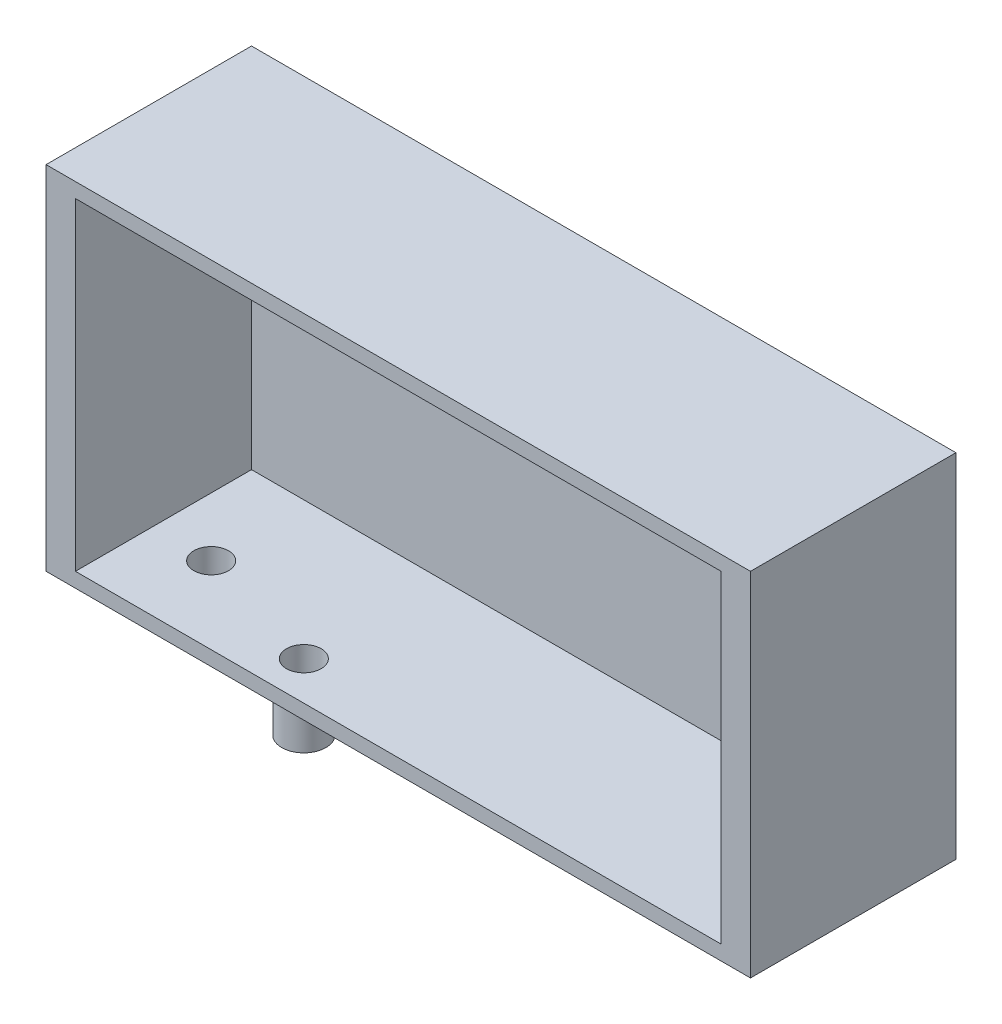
ISO-10303-21;
HEADER;
FILE_DESCRIPTION(('STEP AP214'),'2;1');
FILE_NAME('part.step','',(''),(''),'','','');
FILE_SCHEMA(('AUTOMOTIVE_DESIGN { 1 0 10303 214 1 1 1 1 }'));
ENDSEC;
DATA;
#1=APPLICATION_CONTEXT('core data for automotive mechanical design processes');
#2=APPLICATION_PROTOCOL_DEFINITION('international standard','automotive_design',2000,#1);
#3=PRODUCT_CONTEXT('',#1,'mechanical');
#4=PRODUCT('Part','Part','',(#3));
#5=PRODUCT_RELATED_PRODUCT_CATEGORY('part','',(#4));
#6=PRODUCT_DEFINITION_FORMATION('','',#4);
#7=PRODUCT_DEFINITION_CONTEXT('part definition',#1,'design');
#8=PRODUCT_DEFINITION('design','',#6,#7);
#9=PRODUCT_DEFINITION_SHAPE('','',#8);
#10=(LENGTH_UNIT() NAMED_UNIT(*) SI_UNIT(.MILLI.,.METRE.));
#11=(NAMED_UNIT(*) PLANE_ANGLE_UNIT() SI_UNIT($,.RADIAN.));
#12=(NAMED_UNIT(*) SI_UNIT($,.STERADIAN.) SOLID_ANGLE_UNIT());
#13=UNCERTAINTY_MEASURE_WITH_UNIT(LENGTH_MEASURE(1.E-05),#10,'distance_accuracy_value','');
#14=(GEOMETRIC_REPRESENTATION_CONTEXT(3) GLOBAL_UNCERTAINTY_ASSIGNED_CONTEXT((#13)) GLOBAL_UNIT_ASSIGNED_CONTEXT((#10,
#11,#12)) REPRESENTATION_CONTEXT('',''));
#15=CARTESIAN_POINT('',(0.,0.,0.));
#16=DIRECTION('',(0.,0.,1.));
#17=DIRECTION('',(1.,0.,0.));
#18=AXIS2_PLACEMENT_3D('',#15,#16,#17);
#19=CARTESIAN_POINT('',(0.,0.,711.2));
#20=DIRECTION('',(1.,0.,0.));
#21=DIRECTION('',(0.,1.,0.));
#22=AXIS2_PLACEMENT_3D('',#19,#20,#21);
#23=PLANE('',#22);
#24=DIRECTION('',(0.,-1.,0.));
#25=VECTOR('',#24,1.);
#26=CARTESIAN_POINT('',(0.,0.,0.));
#27=LINE('',#26,#25);
#28=CARTESIAN_POINT('',(-4.44089209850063E-13,1219.2,0.));
#29=VERTEX_POINT('',#28);
#30=CARTESIAN_POINT('',(0.,0.,0.));
#31=VERTEX_POINT('',#30);
#32=EDGE_CURVE('E145',#29,#31,#27,.T.);
#33=ORIENTED_EDGE('',*,*,#32,.T.);
#34=DIRECTION('',(0.,0.,-1.));
#35=VECTOR('',#34,1.);
#36=CARTESIAN_POINT('',(0.,0.,711.2));
#37=LINE('',#36,#35);
#38=CARTESIAN_POINT('',(0.,0.,711.2));
#39=VERTEX_POINT('',#38);
#40=EDGE_CURVE('E169',#39,#31,#37,.T.);
#41=ORIENTED_EDGE('',*,*,#40,.F.);
#42=DIRECTION('',(0.,-1.,0.));
#43=VECTOR('',#42,1.);
#44=CARTESIAN_POINT('',(0.,0.,711.2));
#45=LINE('',#44,#43);
#46=CARTESIAN_POINT('',(-4.44089209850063E-13,1219.2,711.2));
#47=VERTEX_POINT('',#46);
#48=EDGE_CURVE('E149',#47,#39,#45,.T.);
#49=ORIENTED_EDGE('',*,*,#48,.F.);
#50=DIRECTION('',(0.,0.,-1.));
#51=VECTOR('',#50,1.);
#52=CARTESIAN_POINT('',(-4.44089209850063E-13,1219.2,711.2));
#53=LINE('',#52,#51);
#54=EDGE_CURVE('E155',#47,#29,#53,.T.);
#55=ORIENTED_EDGE('',*,*,#54,.T.);
#56=EDGE_LOOP('',(#33,#41,#49,#55));
#57=FACE_BOUND('',#56,.T.);
#58=ADVANCED_FACE('F33',(#57),#23,.F.);
#59=CARTESIAN_POINT('',(0.,0.,711.2));
#60=DIRECTION('',(0.,1.,0.));
#61=DIRECTION('',(0.,0.,1.));
#62=AXIS2_PLACEMENT_3D('',#59,#60,#61);
#63=PLANE('',#62);
#64=CARTESIAN_POINT('',(758.952,0.,577.85));
#65=DIRECTION('',(0.,1.,0.));
#66=DIRECTION('',(0.,0.,1.));
#67=AXIS2_PLACEMENT_3D('',#64,#65,#66);
#68=CIRCLE('',#67,76.2000000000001);
#69=CARTESIAN_POINT('',(758.952,0.,654.05));
#70=VERTEX_POINT('',#69);
#71=EDGE_CURVE('E11',#70,#70,#68,.F.);
#72=ORIENTED_EDGE('',*,*,#71,.F.);
#73=EDGE_LOOP('',(#72));
#74=FACE_BOUND('',#73,.T.);
#75=CARTESIAN_POINT('',(304.8,0.,444.5));
#76=DIRECTION('',(0.,1.,0.));
#77=DIRECTION('',(0.,0.,1.));
#78=AXIS2_PLACEMENT_3D('',#75,#76,#77);
#79=CIRCLE('',#78,76.2);
#80=CARTESIAN_POINT('',(304.8,0.,520.7));
#81=VERTEX_POINT('',#80);
#82=EDGE_CURVE('E40',#81,#81,#79,.F.);
#83=ORIENTED_EDGE('',*,*,#82,.F.);
#84=EDGE_LOOP('',(#83));
#85=FACE_BOUND('',#84,.T.);
#86=DIRECTION('',(1.,0.,0.));
#87=VECTOR('',#86,1.);
#88=CARTESIAN_POINT('',(0.,0.,0.));
#89=LINE('',#88,#87);
#90=CARTESIAN_POINT('',(2438.4,0.,0.));
#91=VERTEX_POINT('',#90);
#92=EDGE_CURVE('E158',#31,#91,#89,.T.);
#93=ORIENTED_EDGE('',*,*,#92,.T.);
#94=DIRECTION('',(0.,0.,-1.));
#95=VECTOR('',#94,1.);
#96=CARTESIAN_POINT('',(2438.4,0.,711.2));
#97=LINE('',#96,#95);
#98=CARTESIAN_POINT('',(2438.4,0.,711.2));
#99=VERTEX_POINT('',#98);
#100=EDGE_CURVE('E166',#99,#91,#97,.T.);
#101=ORIENTED_EDGE('',*,*,#100,.F.);
#102=DIRECTION('',(1.,0.,0.));
#103=VECTOR('',#102,1.);
#104=CARTESIAN_POINT('',(0.,0.,711.2));
#105=LINE('',#104,#103);
#106=EDGE_CURVE('E85',#39,#99,#105,.T.);
#107=ORIENTED_EDGE('',*,*,#106,.F.);
#108=ORIENTED_EDGE('',*,*,#40,.T.);
#109=EDGE_LOOP('',(#93,#101,#107,#108));
#110=FACE_BOUND('',#109,.T.);
#111=ADVANCED_FACE('F175',(#74,#85,#110),#63,.F.);
#112=CARTESIAN_POINT('',(2438.4,0.,711.2));
#113=DIRECTION('',(-1.,0.,0.));
#114=DIRECTION('',(0.,-1.,0.));
#115=AXIS2_PLACEMENT_3D('',#112,#113,#114);
#116=PLANE('',#115);
#117=DIRECTION('',(0.,1.,0.));
#118=VECTOR('',#117,1.);
#119=CARTESIAN_POINT('',(2438.4,0.,0.));
#120=LINE('',#119,#118);
#121=CARTESIAN_POINT('',(2438.4,1219.2,0.));
#122=VERTEX_POINT('',#121);
#123=EDGE_CURVE('E160',#91,#122,#120,.T.);
#124=ORIENTED_EDGE('',*,*,#123,.T.);
#125=DIRECTION('',(0.,0.,-1.));
#126=VECTOR('',#125,1.);
#127=CARTESIAN_POINT('',(2438.4,1219.2,711.2));
#128=LINE('',#127,#126);
#129=CARTESIAN_POINT('',(2438.4,1219.2,711.2));
#130=VERTEX_POINT('',#129);
#131=EDGE_CURVE('E164',#130,#122,#128,.T.);
#132=ORIENTED_EDGE('',*,*,#131,.F.);
#133=DIRECTION('',(0.,1.,0.));
#134=VECTOR('',#133,1.);
#135=CARTESIAN_POINT('',(2438.4,0.,711.2));
#136=LINE('',#135,#134);
#137=EDGE_CURVE('E152',#99,#130,#136,.T.);
#138=ORIENTED_EDGE('',*,*,#137,.F.);
#139=ORIENTED_EDGE('',*,*,#100,.T.);
#140=EDGE_LOOP('',(#124,#132,#138,#139));
#141=FACE_BOUND('',#140,.T.);
#142=ADVANCED_FACE('F177',(#141),#116,.F.);
#143=CARTESIAN_POINT('',(-4.44089209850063E-13,1219.2,711.2));
#144=DIRECTION('',(0.,-1.,0.));
#145=DIRECTION('',(0.,0.,-1.));
#146=AXIS2_PLACEMENT_3D('',#143,#144,#145);
#147=PLANE('',#146);
#148=DIRECTION('',(-1.,0.,0.));
#149=VECTOR('',#148,1.);
#150=CARTESIAN_POINT('',(-4.44089209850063E-13,1219.2,0.));
#151=LINE('',#150,#149);
#152=EDGE_CURVE('E77',#122,#29,#151,.T.);
#153=ORIENTED_EDGE('',*,*,#152,.T.);
#154=ORIENTED_EDGE('',*,*,#54,.F.);
#155=DIRECTION('',(-1.,0.,0.));
#156=VECTOR('',#155,1.);
#157=CARTESIAN_POINT('',(-4.44089209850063E-13,1219.2,711.2));
#158=LINE('',#157,#156);
#159=EDGE_CURVE('E56',#130,#47,#158,.T.);
#160=ORIENTED_EDGE('',*,*,#159,.F.);
#161=ORIENTED_EDGE('',*,*,#131,.T.);
#162=EDGE_LOOP('',(#153,#154,#160,#161));
#163=FACE_BOUND('',#162,.T.);
#164=ADVANCED_FACE('F189',(#163),#147,.F.);
#165=CARTESIAN_POINT('',(0.,0.,711.2));
#166=DIRECTION('',(0.,0.,-1.));
#167=DIRECTION('',(-1.,0.,0.));
#168=AXIS2_PLACEMENT_3D('',#165,#166,#167);
#169=PLANE('',#168);
#170=DIRECTION('',(-1.,0.,0.));
#171=VECTOR('',#170,1.);
#172=CARTESIAN_POINT('',(2336.8,1168.4,711.2));
#173=LINE('',#172,#171);
#174=CARTESIAN_POINT('',(2336.8,1168.4,711.2));
#175=VERTEX_POINT('',#174);
#176=CARTESIAN_POINT('',(101.6,1168.4,711.2));
#177=VERTEX_POINT('',#176);
#178=EDGE_CURVE('E139',#175,#177,#173,.T.);
#179=ORIENTED_EDGE('',*,*,#178,.F.);
#180=DIRECTION('',(0.,1.,0.));
#181=VECTOR('',#180,1.);
#182=CARTESIAN_POINT('',(2336.8,50.7999999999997,711.2));
#183=LINE('',#182,#181);
#184=CARTESIAN_POINT('',(2336.8,50.7999999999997,711.2));
#185=VERTEX_POINT('',#184);
#186=EDGE_CURVE('E47',#185,#175,#183,.T.);
#187=ORIENTED_EDGE('',*,*,#186,.F.);
#188=DIRECTION('',(1.,0.,0.));
#189=VECTOR('',#188,1.);
#190=CARTESIAN_POINT('',(2336.8,50.7999999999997,711.2));
#191=LINE('',#190,#189);
#192=CARTESIAN_POINT('',(101.6,50.7999999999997,711.2));
#193=VERTEX_POINT('',#192);
#194=EDGE_CURVE('E127',#193,#185,#191,.T.);
#195=ORIENTED_EDGE('',*,*,#194,.F.);
#196=DIRECTION('',(0.,-1.,0.));
#197=VECTOR('',#196,1.);
#198=CARTESIAN_POINT('',(101.6,50.7999999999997,711.2));
#199=LINE('',#198,#197);
#200=EDGE_CURVE('E130',#177,#193,#199,.T.);
#201=ORIENTED_EDGE('',*,*,#200,.F.);
#202=EDGE_LOOP('',(#179,#187,#195,#201));
#203=FACE_BOUND('',#202,.T.);
#204=ORIENTED_EDGE('',*,*,#48,.T.);
#205=ORIENTED_EDGE('',*,*,#106,.T.);
#206=ORIENTED_EDGE('',*,*,#137,.T.);
#207=ORIENTED_EDGE('',*,*,#159,.T.);
#208=EDGE_LOOP('',(#204,#205,#206,#207));
#209=FACE_BOUND('',#208,.T.);
#210=ADVANCED_FACE('F191',(#203,#209),#169,.F.);
#211=CARTESIAN_POINT('',(0.,0.,0.));
#212=DIRECTION('',(0.,0.,-1.));
#213=DIRECTION('',(-1.,0.,0.));
#214=AXIS2_PLACEMENT_3D('',#211,#212,#213);
#215=PLANE('',#214);
#216=ORIENTED_EDGE('',*,*,#32,.F.);
#217=ORIENTED_EDGE('',*,*,#152,.F.);
#218=ORIENTED_EDGE('',*,*,#123,.F.);
#219=ORIENTED_EDGE('',*,*,#92,.F.);
#220=EDGE_LOOP('',(#216,#217,#218,#219));
#221=FACE_BOUND('',#220,.T.);
#222=ADVANCED_FACE('F186',(#221),#215,.T.);
#223=CARTESIAN_POINT('',(2336.8,50.7999999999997,101.6));
#224=DIRECTION('',(1.,0.,0.));
#225=DIRECTION('',(0.,0.,-1.));
#226=AXIS2_PLACEMENT_3D('',#223,#224,#225);
#227=PLANE('',#226);
#228=ORIENTED_EDGE('',*,*,#186,.T.);
#229=DIRECTION('',(0.,0.,1.));
#230=VECTOR('',#229,1.);
#231=CARTESIAN_POINT('',(2336.8,1168.4,101.6));
#232=LINE('',#231,#230);
#233=CARTESIAN_POINT('',(2336.8,1168.4,101.6));
#234=VERTEX_POINT('',#233);
#235=EDGE_CURVE('E105',#234,#175,#232,.T.);
#236=ORIENTED_EDGE('',*,*,#235,.F.);
#237=DIRECTION('',(0.,1.,0.));
#238=VECTOR('',#237,1.);
#239=CARTESIAN_POINT('',(2336.8,50.7999999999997,101.6));
#240=LINE('',#239,#238);
#241=CARTESIAN_POINT('',(2336.8,50.7999999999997,101.6));
#242=VERTEX_POINT('',#241);
#243=EDGE_CURVE('E109',#242,#234,#240,.T.);
#244=ORIENTED_EDGE('',*,*,#243,.F.);
#245=DIRECTION('',(0.,0.,1.));
#246=VECTOR('',#245,1.);
#247=CARTESIAN_POINT('',(2336.8,50.7999999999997,101.6));
#248=LINE('',#247,#246);
#249=EDGE_CURVE('E143',#242,#185,#248,.T.);
#250=ORIENTED_EDGE('',*,*,#249,.T.);
#251=EDGE_LOOP('',(#228,#236,#244,#250));
#252=FACE_BOUND('',#251,.T.);
#253=ADVANCED_FACE('F107',(#252),#227,.F.);
#254=CARTESIAN_POINT('',(2336.8,50.7999999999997,101.6));
#255=DIRECTION('',(0.,-1.,0.));
#256=DIRECTION('',(1.,0.,0.));
#257=AXIS2_PLACEMENT_3D('',#254,#255,#256);
#258=PLANE('',#257);
#259=CARTESIAN_POINT('',(304.8,50.7999999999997,444.5));
#260=DIRECTION('',(0.,-1.,0.));
#261=DIRECTION('',(1.,0.,0.));
#262=AXIS2_PLACEMENT_3D('',#259,#260,#261);
#263=CIRCLE('',#262,60.071);
#264=CARTESIAN_POINT('',(364.871,50.7999999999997,444.5));
#265=VERTEX_POINT('',#264);
#266=EDGE_CURVE('E337',#265,#265,#263,.F.);
#267=ORIENTED_EDGE('',*,*,#266,.F.);
#268=EDGE_LOOP('',(#267));
#269=FACE_BOUND('',#268,.T.);
#270=CARTESIAN_POINT('',(758.952,50.7999999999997,577.85));
#271=DIRECTION('',(0.,-1.,0.));
#272=DIRECTION('',(1.,0.,0.));
#273=AXIS2_PLACEMENT_3D('',#270,#271,#272);
#274=CIRCLE('',#273,60.0709999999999);
#275=CARTESIAN_POINT('',(819.023,50.7999999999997,577.85));
#276=VERTEX_POINT('',#275);
#277=EDGE_CURVE('E341',#276,#276,#274,.F.);
#278=ORIENTED_EDGE('',*,*,#277,.F.);
#279=EDGE_LOOP('',(#278));
#280=FACE_BOUND('',#279,.T.);
#281=ORIENTED_EDGE('',*,*,#194,.T.);
#282=ORIENTED_EDGE('',*,*,#249,.F.);
#283=DIRECTION('',(1.,0.,0.));
#284=VECTOR('',#283,1.);
#285=CARTESIAN_POINT('',(2336.8,50.7999999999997,101.6));
#286=LINE('',#285,#284);
#287=CARTESIAN_POINT('',(101.6,50.7999999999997,101.6));
#288=VERTEX_POINT('',#287);
#289=EDGE_CURVE('E115',#288,#242,#286,.T.);
#290=ORIENTED_EDGE('',*,*,#289,.F.);
#291=DIRECTION('',(0.,0.,1.));
#292=VECTOR('',#291,1.);
#293=CARTESIAN_POINT('',(101.6,50.7999999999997,101.6));
#294=LINE('',#293,#292);
#295=EDGE_CURVE('E146',#288,#193,#294,.T.);
#296=ORIENTED_EDGE('',*,*,#295,.T.);
#297=EDGE_LOOP('',(#281,#282,#290,#296));
#298=FACE_BOUND('',#297,.T.);
#299=ADVANCED_FACE('F240',(#269,#280,#298),#258,.F.);
#300=CARTESIAN_POINT('',(101.6,50.7999999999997,101.6));
#301=DIRECTION('',(-1.,0.,0.));
#302=DIRECTION('',(0.,0.,1.));
#303=AXIS2_PLACEMENT_3D('',#300,#301,#302);
#304=PLANE('',#303);
#305=ORIENTED_EDGE('',*,*,#200,.T.);
#306=ORIENTED_EDGE('',*,*,#295,.F.);
#307=DIRECTION('',(0.,-1.,0.));
#308=VECTOR('',#307,1.);
#309=CARTESIAN_POINT('',(101.6,50.7999999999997,101.6));
#310=LINE('',#309,#308);
#311=CARTESIAN_POINT('',(101.6,1168.4,101.6));
#312=VERTEX_POINT('',#311);
#313=EDGE_CURVE('E123',#312,#288,#310,.T.);
#314=ORIENTED_EDGE('',*,*,#313,.F.);
#315=DIRECTION('',(0.,0.,1.));
#316=VECTOR('',#315,1.);
#317=CARTESIAN_POINT('',(101.6,1168.4,101.6));
#318=LINE('',#317,#316);
#319=EDGE_CURVE('E114',#312,#177,#318,.T.);
#320=ORIENTED_EDGE('',*,*,#319,.T.);
#321=EDGE_LOOP('',(#305,#306,#314,#320));
#322=FACE_BOUND('',#321,.T.);
#323=ADVANCED_FACE('F247',(#322),#304,.F.);
#324=CARTESIAN_POINT('',(2336.8,1168.4,101.6));
#325=DIRECTION('',(0.,1.,0.));
#326=DIRECTION('',(-1.,0.,0.));
#327=AXIS2_PLACEMENT_3D('',#324,#325,#326);
#328=PLANE('',#327);
#329=ORIENTED_EDGE('',*,*,#178,.T.);
#330=ORIENTED_EDGE('',*,*,#319,.F.);
#331=DIRECTION('',(-1.,0.,0.));
#332=VECTOR('',#331,1.);
#333=CARTESIAN_POINT('',(2336.8,1168.4,101.6));
#334=LINE('',#333,#332);
#335=EDGE_CURVE('E118',#234,#312,#334,.T.);
#336=ORIENTED_EDGE('',*,*,#335,.F.);
#337=ORIENTED_EDGE('',*,*,#235,.T.);
#338=EDGE_LOOP('',(#329,#330,#336,#337));
#339=FACE_BOUND('',#338,.T.);
#340=ADVANCED_FACE('F119',(#339),#328,.F.);
#341=CARTESIAN_POINT('',(0.,0.,101.6));
#342=DIRECTION('',(0.,0.,1.));
#343=DIRECTION('',(1.,0.,0.));
#344=AXIS2_PLACEMENT_3D('',#341,#342,#343);
#345=PLANE('',#344);
#346=ORIENTED_EDGE('',*,*,#243,.T.);
#347=ORIENTED_EDGE('',*,*,#335,.T.);
#348=ORIENTED_EDGE('',*,*,#313,.T.);
#349=ORIENTED_EDGE('',*,*,#289,.T.);
#350=EDGE_LOOP('',(#346,#347,#348,#349));
#351=FACE_BOUND('',#350,.T.);
#352=ADVANCED_FACE('F125',(#351),#345,.T.);
#353=CARTESIAN_POINT('',(304.8,-177.8,444.5));
#354=DIRECTION('',(0.,1.,0.));
#355=DIRECTION('',(0.,0.,1.));
#356=AXIS2_PLACEMENT_3D('',#353,#354,#355);
#357=CYLINDRICAL_SURFACE('',#356,76.2);
#358=CARTESIAN_POINT('',(304.8,-177.8,444.5));
#359=DIRECTION('',(0.,-1.,0.));
#360=DIRECTION('',(0.,0.,-1.));
#361=AXIS2_PLACEMENT_3D('',#358,#359,#360);
#362=CIRCLE('',#361,76.2);
#363=CARTESIAN_POINT('',(304.8,-177.8,368.3));
#364=VERTEX_POINT('',#363);
#365=EDGE_CURVE('E133',#364,#364,#362,.T.);
#366=ORIENTED_EDGE('',*,*,#365,.F.);
#367=EDGE_LOOP('',(#366));
#368=FACE_BOUND('',#367,.T.);
#369=ORIENTED_EDGE('',*,*,#82,.T.);
#370=EDGE_LOOP('',(#369));
#371=FACE_BOUND('',#370,.T.);
#372=ADVANCED_FACE('F173',(#368,#371),#357,.T.);
#373=CARTESIAN_POINT('',(304.8,-177.8,444.5));
#374=DIRECTION('',(0.,-1.,0.));
#375=DIRECTION('',(0.,0.,-1.));
#376=AXIS2_PLACEMENT_3D('',#373,#374,#375);
#377=PLANE('',#376);
#378=CARTESIAN_POINT('',(304.8,-177.8,444.5));
#379=DIRECTION('',(0.,-1.,0.));
#380=DIRECTION('',(0.,0.,-1.));
#381=AXIS2_PLACEMENT_3D('',#378,#379,#380);
#382=CIRCLE('',#381,60.071);
#383=CARTESIAN_POINT('',(304.8,-177.8,384.429));
#384=VERTEX_POINT('',#383);
#385=EDGE_CURVE('E344',#384,#384,#382,.T.);
#386=ORIENTED_EDGE('',*,*,#385,.F.);
#387=EDGE_LOOP('',(#386));
#388=FACE_BOUND('',#387,.T.);
#389=ORIENTED_EDGE('',*,*,#365,.T.);
#390=EDGE_LOOP('',(#389));
#391=FACE_BOUND('',#390,.T.);
#392=ADVANCED_FACE('F275',(#388,#391),#377,.T.);
#393=CARTESIAN_POINT('',(758.952,-177.8,577.85));
#394=DIRECTION('',(0.,1.,0.));
#395=DIRECTION('',(0.,0.,1.));
#396=AXIS2_PLACEMENT_3D('',#393,#394,#395);
#397=CYLINDRICAL_SURFACE('',#396,76.2000000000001);
#398=CARTESIAN_POINT('',(758.952,-177.8,577.85));
#399=DIRECTION('',(0.,-1.,0.));
#400=DIRECTION('',(0.,0.,-1.));
#401=AXIS2_PLACEMENT_3D('',#398,#399,#400);
#402=CIRCLE('',#401,76.2000000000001);
#403=CARTESIAN_POINT('',(758.952,-177.8,501.65));
#404=VERTEX_POINT('',#403);
#405=EDGE_CURVE('E352',#404,#404,#402,.T.);
#406=ORIENTED_EDGE('',*,*,#405,.F.);
#407=EDGE_LOOP('',(#406));
#408=FACE_BOUND('',#407,.T.);
#409=ORIENTED_EDGE('',*,*,#71,.T.);
#410=EDGE_LOOP('',(#409));
#411=FACE_BOUND('',#410,.T.);
#412=ADVANCED_FACE('F283',(#408,#411),#397,.T.);
#413=CARTESIAN_POINT('',(758.952,-177.8,577.85));
#414=DIRECTION('',(0.,-1.,0.));
#415=DIRECTION('',(0.,0.,-1.));
#416=AXIS2_PLACEMENT_3D('',#413,#414,#415);
#417=PLANE('',#416);
#418=CARTESIAN_POINT('',(758.952,-177.8,577.85));
#419=DIRECTION('',(0.,-1.,0.));
#420=DIRECTION('',(0.,0.,-1.));
#421=AXIS2_PLACEMENT_3D('',#418,#419,#420);
#422=CIRCLE('',#421,60.0709999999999);
#423=CARTESIAN_POINT('',(758.952,-177.8,517.779));
#424=VERTEX_POINT('',#423);
#425=EDGE_CURVE('E345',#424,#424,#422,.T.);
#426=ORIENTED_EDGE('',*,*,#425,.F.);
#427=EDGE_LOOP('',(#426));
#428=FACE_BOUND('',#427,.T.);
#429=ORIENTED_EDGE('',*,*,#405,.T.);
#430=EDGE_LOOP('',(#429));
#431=FACE_BOUND('',#430,.T.);
#432=ADVANCED_FACE('F292',(#428,#431),#417,.T.);
#433=CARTESIAN_POINT('',(758.952,220.706445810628,577.85));
#434=DIRECTION('',(0.,-1.,0.));
#435=DIRECTION('',(0.,0.,-1.));
#436=AXIS2_PLACEMENT_3D('',#433,#434,#435);
#437=CYLINDRICAL_SURFACE('',#436,60.0709999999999);
#438=ORIENTED_EDGE('',*,*,#277,.T.);
#439=EDGE_LOOP('',(#438));
#440=FACE_BOUND('',#439,.T.);
#441=ORIENTED_EDGE('',*,*,#425,.T.);
#442=EDGE_LOOP('',(#441));
#443=FACE_BOUND('',#442,.T.);
#444=ADVANCED_FACE('F299',(#440,#443),#437,.F.);
#445=CARTESIAN_POINT('',(304.8,220.706445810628,444.5));
#446=DIRECTION('',(0.,-1.,0.));
#447=DIRECTION('',(0.,0.,-1.));
#448=AXIS2_PLACEMENT_3D('',#445,#446,#447);
#449=CYLINDRICAL_SURFACE('',#448,60.071);
#450=ORIENTED_EDGE('',*,*,#266,.T.);
#451=EDGE_LOOP('',(#450));
#452=FACE_BOUND('',#451,.T.);
#453=ORIENTED_EDGE('',*,*,#385,.T.);
#454=EDGE_LOOP('',(#453));
#455=FACE_BOUND('',#454,.T.);
#456=ADVANCED_FACE('F307',(#452,#455),#449,.F.);
#457=CLOSED_SHELL('',(#58,#111,#142,#164,#210,#222,#253,#299,#323,#340,#352,#372,#392,#412,#432,
#444,#456));
#458=MANIFOLD_SOLID_BREP('B2',#457);
#459=ADVANCED_BREP_SHAPE_REPRESENTATION('',(#18,#458),#14);
#460=SHAPE_DEFINITION_REPRESENTATION(#9,#459);
ENDSEC;
END-ISO-10303-21;
